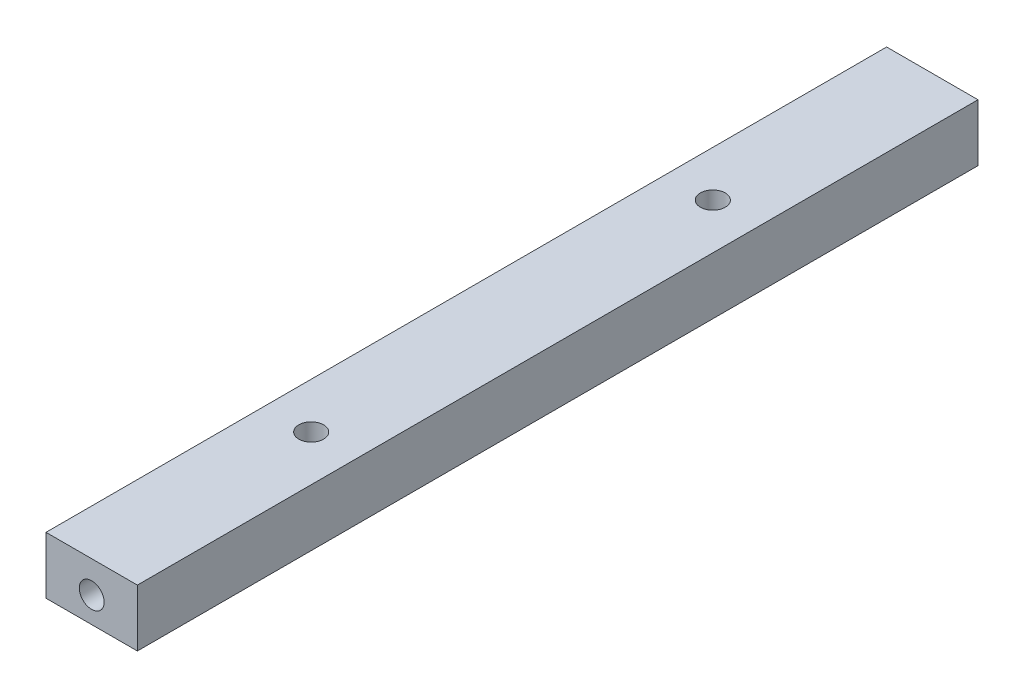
from build123d import *

# Parameters (mm, degrees)
SKETCH1_W       = 12.7
SKETCH1_H       = 7.9375
MOUNT_BAR_DEPTH = 116.84
SKETCH2_R       = 1.7272
END_HOLE1_DEPTH = 10.16
END_HOLE2_START = -10.16
SKETCH3_R       = 1.7272
END_HOLE2_DEPTH = 10.16
SKETCH4_R       = 1.7272
TOP_HOLES_DEPTH = 10.16


with BuildPart() as part:
    # Sketch1 → mount_bar (new body)
    with BuildSketch(Plane.XY):
        with Locations((6.35, 3.96875)):
            Rectangle(SKETCH1_W, SKETCH1_H)
    extrude(amount=MOUNT_BAR_DEPTH)

    # Sketch2 → end_hole1 (cut)
    with BuildSketch(Plane.XY.offset(116.84)):
        with Locations((6.35, 3.556)):
            Circle(SKETCH2_R)
    extrude(amount=-END_HOLE1_DEPTH, mode=Mode.SUBTRACT)

    # Sketch3 → end_hole2 (cut)
    with BuildSketch(Plane(origin=(0, 0, 0), x_dir=(-1, 0, 0), z_dir=(0, 0, -1)).offset(END_HOLE2_START)):
        with Locations(Location((-6.35, 3.556, 0), (0, 0, 180))):
            Circle(SKETCH3_R)
    extrude(amount=END_HOLE2_DEPTH, mode=Mode.SUBTRACT)

    # Sketch4 → top_holes (cut)
    with BuildSketch(Plane(origin=(0, 7.9375, 0), x_dir=(-1, 0, 0), z_dir=(0, 1, 0))):
        with Locations(Location((-6.35, 30.508249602, 0), (0, 0, 90))):
            Circle(SKETCH4_R)
        with Locations(Location((-6.35, 86.331750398, 0), (0, 0, 90))):
            Circle(SKETCH4_R)
    extrude(amount=-TOP_HOLES_DEPTH, mode=Mode.SUBTRACT)


solid = part.part
